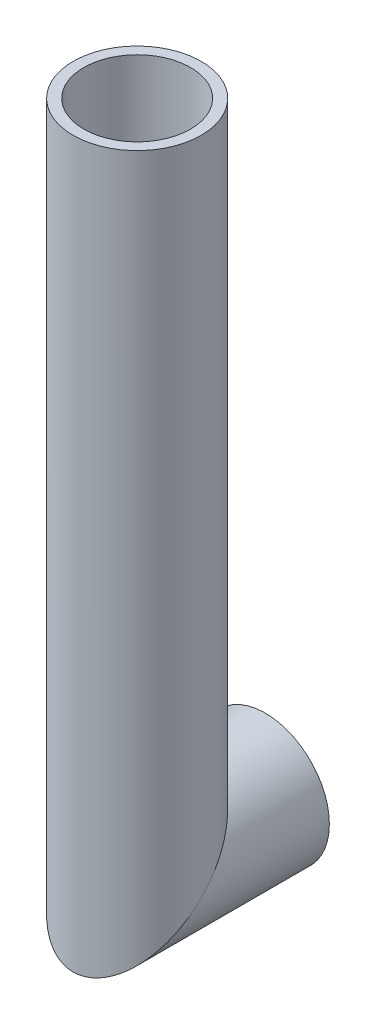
ISO-10303-21;
HEADER;
FILE_DESCRIPTION(('STEP AP214'),'2;1');
FILE_NAME('part.step','',(''),(''),'','','');
FILE_SCHEMA(('AUTOMOTIVE_DESIGN { 1 0 10303 214 1 1 1 1 }'));
ENDSEC;
DATA;
#1=APPLICATION_CONTEXT('core data for automotive mechanical design processes');
#2=APPLICATION_PROTOCOL_DEFINITION('international standard','automotive_design',2000,#1);
#3=PRODUCT_CONTEXT('',#1,'mechanical');
#4=PRODUCT('Part','Part','',(#3));
#5=PRODUCT_RELATED_PRODUCT_CATEGORY('part','',(#4));
#6=PRODUCT_DEFINITION_FORMATION('','',#4);
#7=PRODUCT_DEFINITION_CONTEXT('part definition',#1,'design');
#8=PRODUCT_DEFINITION('design','',#6,#7);
#9=PRODUCT_DEFINITION_SHAPE('','',#8);
#10=(LENGTH_UNIT() NAMED_UNIT(*) SI_UNIT(.MILLI.,.METRE.));
#11=(NAMED_UNIT(*) PLANE_ANGLE_UNIT() SI_UNIT($,.RADIAN.));
#12=(NAMED_UNIT(*) SI_UNIT($,.STERADIAN.) SOLID_ANGLE_UNIT());
#13=UNCERTAINTY_MEASURE_WITH_UNIT(LENGTH_MEASURE(1.E-05),#10,'distance_accuracy_value','');
#14=(GEOMETRIC_REPRESENTATION_CONTEXT(3) GLOBAL_UNCERTAINTY_ASSIGNED_CONTEXT((#13)) GLOBAL_UNIT_ASSIGNED_CONTEXT((#10,
#11,#12)) REPRESENTATION_CONTEXT('',''));
#15=CARTESIAN_POINT('',(0.,0.,0.));
#16=DIRECTION('',(0.,0.,1.));
#17=DIRECTION('',(1.,0.,0.));
#18=AXIS2_PLACEMENT_3D('',#15,#16,#17);
#19=CARTESIAN_POINT('',(0.,-13.3,12.));
#20=DIRECTION('',(0.,1.,0.));
#21=DIRECTION('',(0.,0.,1.));
#22=AXIS2_PLACEMENT_3D('',#19,#20,#21);
#23=CYLINDRICAL_SURFACE('',#22,6.);
#24=CARTESIAN_POINT('',(0.,0.,12.));
#25=DIRECTION('',(0.,0.707106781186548,0.707106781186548));
#26=DIRECTION('',(0.,-0.707106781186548,0.707106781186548));
#27=AXIS2_PLACEMENT_3D('',#24,#25,#26);
#28=ELLIPSE('',#27,8.48528137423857,6.);
#29=CARTESIAN_POINT('',(0.,-6.,18.));
#30=VERTEX_POINT('',#29);
#31=EDGE_CURVE('E42',#30,#30,#28,.F.);
#32=ORIENTED_EDGE('',*,*,#31,.F.);
#33=EDGE_LOOP('',(#32));
#34=FACE_BOUND('',#33,.T.);
#35=CARTESIAN_POINT('',(0.,61.86,12.));
#36=DIRECTION('',(0.,1.,0.));
#37=DIRECTION('',(1.,0.,0.));
#38=AXIS2_PLACEMENT_3D('',#35,#36,#37);
#39=CIRCLE('',#38,6.);
#40=CARTESIAN_POINT('',(6.,61.86,12.));
#41=VERTEX_POINT('',#40);
#42=EDGE_CURVE('E54',#41,#41,#39,.T.);
#43=ORIENTED_EDGE('',*,*,#42,.F.);
#44=EDGE_LOOP('',(#43));
#45=FACE_BOUND('',#44,.T.);
#46=ADVANCED_FACE('F39',(#34,#45),#23,.T.);
#47=CARTESIAN_POINT('',(0.,0.,0.));
#48=DIRECTION('',(0.,0.,1.));
#49=DIRECTION('',(1.,0.,0.));
#50=AXIS2_PLACEMENT_3D('',#47,#48,#49);
#51=CYLINDRICAL_SURFACE('',#50,6.);
#52=CARTESIAN_POINT('',(0.,0.,0.));
#53=DIRECTION('',(0.,0.,1.));
#54=DIRECTION('',(1.,0.,0.));
#55=AXIS2_PLACEMENT_3D('',#52,#53,#54);
#56=CIRCLE('',#55,6.);
#57=CARTESIAN_POINT('',(6.,0.,0.));
#58=VERTEX_POINT('',#57);
#59=EDGE_CURVE('E60',#58,#58,#56,.T.);
#60=ORIENTED_EDGE('',*,*,#59,.T.);
#61=EDGE_LOOP('',(#60));
#62=FACE_BOUND('',#61,.T.);
#63=ORIENTED_EDGE('',*,*,#31,.T.);
#64=EDGE_LOOP('',(#63));
#65=FACE_BOUND('',#64,.T.);
#66=ADVANCED_FACE('F90',(#62,#65),#51,.T.);
#67=CARTESIAN_POINT('',(0.,61.86,12.));
#68=DIRECTION('',(0.,1.,0.));
#69=DIRECTION('',(1.,0.,0.));
#70=AXIS2_PLACEMENT_3D('',#67,#68,#69);
#71=PLANE('',#70);
#72=CARTESIAN_POINT('',(0.,61.86,12.));
#73=DIRECTION('',(0.,1.,0.));
#74=DIRECTION('',(1.,0.,0.));
#75=AXIS2_PLACEMENT_3D('',#72,#73,#74);
#76=CIRCLE('',#75,5.);
#77=CARTESIAN_POINT('',(5.,61.86,12.));
#78=VERTEX_POINT('',#77);
#79=EDGE_CURVE('E80',#78,#78,#76,.F.);
#80=ORIENTED_EDGE('',*,*,#79,.T.);
#81=EDGE_LOOP('',(#80));
#82=FACE_BOUND('',#81,.T.);
#83=ORIENTED_EDGE('',*,*,#42,.T.);
#84=EDGE_LOOP('',(#83));
#85=FACE_BOUND('',#84,.T.);
#86=ADVANCED_FACE('F92',(#82,#85),#71,.T.);
#87=CARTESIAN_POINT('',(0.,0.,0.));
#88=DIRECTION('',(0.,0.,1.));
#89=DIRECTION('',(1.,0.,0.));
#90=AXIS2_PLACEMENT_3D('',#87,#88,#89);
#91=PLANE('',#90);
#92=CARTESIAN_POINT('',(0.,0.,0.));
#93=DIRECTION('',(0.,0.,1.));
#94=DIRECTION('',(1.,0.,0.));
#95=AXIS2_PLACEMENT_3D('',#92,#93,#94);
#96=CIRCLE('',#95,5.);
#97=CARTESIAN_POINT('',(5.,0.,0.));
#98=VERTEX_POINT('',#97);
#99=EDGE_CURVE('E48',#98,#98,#96,.F.);
#100=ORIENTED_EDGE('',*,*,#99,.F.);
#101=EDGE_LOOP('',(#100));
#102=FACE_BOUND('',#101,.T.);
#103=ORIENTED_EDGE('',*,*,#59,.F.);
#104=EDGE_LOOP('',(#103));
#105=FACE_BOUND('',#104,.T.);
#106=ADVANCED_FACE('F76',(#102,#105),#91,.F.);
#107=CARTESIAN_POINT('',(0.,-11.1,12.));
#108=DIRECTION('',(0.,1.,0.));
#109=DIRECTION('',(0.,0.,1.));
#110=AXIS2_PLACEMENT_3D('',#107,#108,#109);
#111=CYLINDRICAL_SURFACE('',#110,5.);
#112=CARTESIAN_POINT('',(0.,0.,12.));
#113=DIRECTION('',(0.,0.707106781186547,0.707106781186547));
#114=DIRECTION('',(0.,-0.707106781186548,0.707106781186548));
#115=AXIS2_PLACEMENT_3D('',#112,#113,#114);
#116=ELLIPSE('',#115,7.07106781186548,5.);
#117=CARTESIAN_POINT('',(0.,-5.,17.));
#118=VERTEX_POINT('',#117);
#119=EDGE_CURVE('E11',#118,#118,#116,.T.);
#120=ORIENTED_EDGE('',*,*,#119,.F.);
#121=EDGE_LOOP('',(#120));
#122=FACE_BOUND('',#121,.T.);
#123=ORIENTED_EDGE('',*,*,#79,.F.);
#124=EDGE_LOOP('',(#123));
#125=FACE_BOUND('',#124,.T.);
#126=ADVANCED_FACE('F101',(#122,#125),#111,.F.);
#127=CARTESIAN_POINT('',(0.,0.,0.));
#128=DIRECTION('',(0.,0.,1.));
#129=DIRECTION('',(1.,0.,0.));
#130=AXIS2_PLACEMENT_3D('',#127,#128,#129);
#131=CYLINDRICAL_SURFACE('',#130,5.);
#132=ORIENTED_EDGE('',*,*,#99,.T.);
#133=EDGE_LOOP('',(#132));
#134=FACE_BOUND('',#133,.T.);
#135=ORIENTED_EDGE('',*,*,#119,.T.);
#136=EDGE_LOOP('',(#135));
#137=FACE_BOUND('',#136,.T.);
#138=ADVANCED_FACE('F99',(#134,#137),#131,.F.);
#139=CLOSED_SHELL('',(#46,#66,#86,#106,#126,#138));
#140=MANIFOLD_SOLID_BREP('B2',#139);
#141=ADVANCED_BREP_SHAPE_REPRESENTATION('',(#18,#140),#14);
#142=SHAPE_DEFINITION_REPRESENTATION(#9,#141);
ENDSEC;
END-ISO-10303-21;
